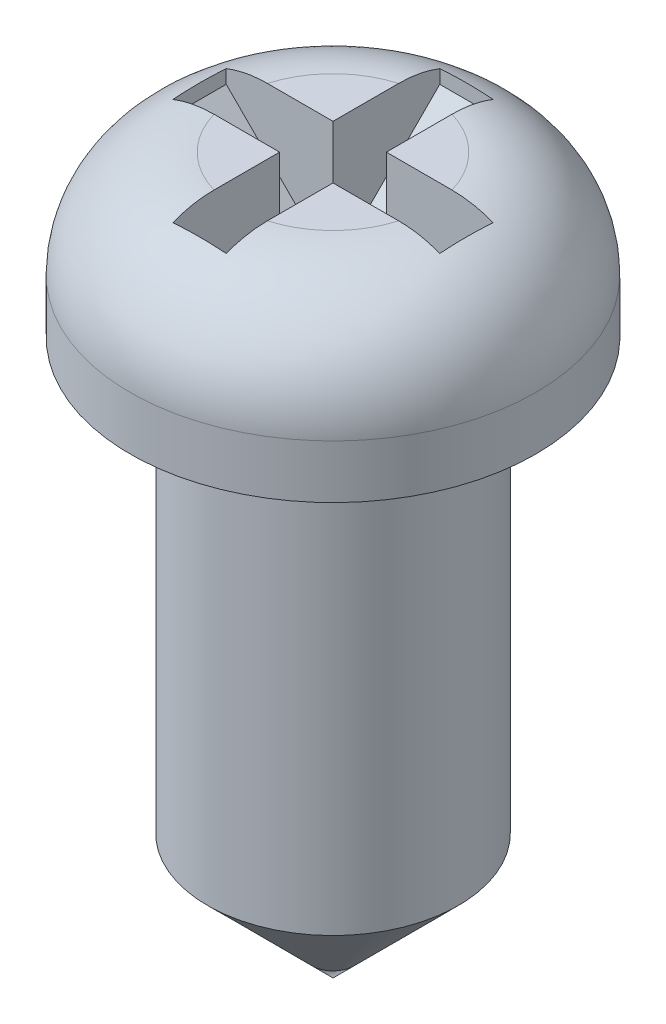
from build123d import *

# Parameters (mm, degrees)
CUT_EXTRUDE1_DEPTH = 1
CHAMFER1_SIZE      = 0.8


with BuildPart() as part:
    # Sketch1 → Revolve1 (revolve)
    with BuildSketch(Plane.XY, mode=Mode.PRIVATE) as revolve1_sk:
        with BuildLine():
            Line((1.175, 0), (1.9, 0))
            Line((1.9, 0), (1.9, 0.5))
            ThreePointArc((1.9, 0.5), (1.607106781, 1.207106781), (0.9, 1.5))
            Line((0.9, 1.5), (0, 1.5))
            Line((0, 1.5), (0, -5.2))
            Line((0, -5.2), (1.175, -4.025))
            Line((1.175, -4.025), (1.175, 0))
        make_face()
    revolve(revolve1_sk.sketch.rotate(Axis((0, -5.2, 0), (0, -1, 0)), 180), axis=Axis((0, -5.2, 0), (0, -1, 0)))

    # Sketch2 → Cut-Extrude1 (cut)
    with BuildSketch(Plane(origin=(0, 1.5, 0), x_dir=(1, 0, 0), z_dir=(0, 1, 0))):
        Polygon((0.25, 0.25), (1.25, 0.25), (1.25, -0.25), (0.25, -0.25), (0.25, -1.25), (-0.25, -1.25), (-0.25, -0.25), (-1.25, -0.25), (-1.25, 0.25), (-0.25, 0.25), (-0.25, 1.25), (0.25, 1.25), align=None)
    extrude(amount=-CUT_EXTRUDE1_DEPTH, mode=Mode.SUBTRACT)

    # Chamfer1
    chamfer1_edges = [part.edges().sort_by_distance(p)[0] for p in [
        (-1.25, 0.5, 0),
        (0, 0.5, -1.25),
        (1.25, 0.5, 0),
        (0, 0.5, 1.25),
    ]]
    chamfer(chamfer1_edges, length=CHAMFER1_SIZE)


solid = part.part
